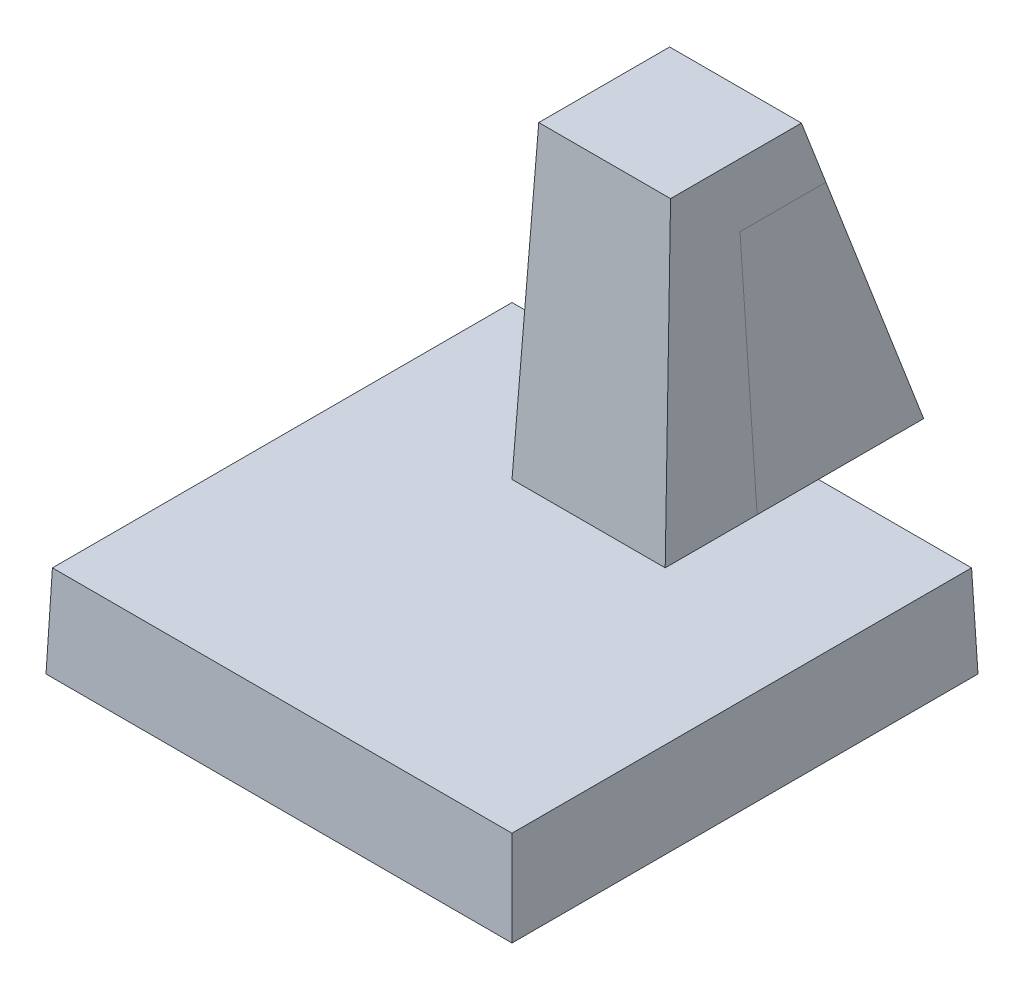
from build123d import *

# Parameters (mm, degrees)
BOSS_EXTRUDE1_DEPTH = 2.5
SKETCH2_W           = 15
SKETCH2_H           = 15
BOSS_EXTRUDE2_DEPTH = 3
BOSS_EXTRUDE2_DRAFT = 2
DRAFT1_ANGLE        = 2
BOSS_EXTRUDE3_DEPTH = 2.5
DRAFT2_ANGLE        = 2


with BuildPart() as part:
    # Sketch1 → Boss-Extrude1 (new, symmetric)
    with BuildSketch(Plane(origin=(0, 0, 0), x_dir=(0, 0, -1), z_dir=(1, 0, 0))):
        Polygon((0, 0), (0.524077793, 10), (4.796137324, 10), (5.524077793, 8), (2.720633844, 8), (3, 0), align=None)
    extrude(amount=BOSS_EXTRUDE1_DEPTH, both=True)


with BuildPart() as boss_extrude2_tool:
    # Sketch2 → Boss-Extrude2 (with draft: the straight prism first)
    with BuildSketch(Plane(origin=(0, 0, 0), x_dir=(1, 0, 0), z_dir=(0, 1, 0))):
        with Locations((0, -2.5)):
            Rectangle(SKETCH2_W, SKETCH2_H)
    extrude(amount=-BOSS_EXTRUDE2_DEPTH)
    # Boss-Extrude2: the draft: its side faces are tilted about the plane it starts from
    boss_extrude2_sides = [boss_extrude2_tool.faces().sort_by_distance(p)[0] for p in [
        (-7.5, -1.5, 2.5),
        (0, -1.5, 10),
        (7.5, -1.5, 2.5),
        (0, -1.5, -5),
    ]]
    draft(boss_extrude2_sides, Plane(origin=(0, 0, 0), x_dir=(1, 0, 0), z_dir=(0, 1, 0)), BOSS_EXTRUDE2_DRAFT)


with BuildPart() as part_1:
    add(part.part)

    # Boss-Extrude2: add boss_extrude2_tool
    add(boss_extrude2_tool.part)

    # Draft1
    draft1_faces = [part_1.faces().sort_by_distance(p)[0] for p in [
        (-2.5, 5.402140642, -1.928064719),
        (2.5, 5.402140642, -1.928064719),
    ]]
    draft(draft1_faces, Plane.ZX, DRAFT1_ANGLE)


with BuildPart() as body_2:
    # Sketch3 → Boss-Extrude3 (new, symmetric)
    with BuildSketch(Plane(origin=(0, 0, 0), x_dir=(0, 0, -1), z_dir=(1, 0, 0))):
        Polygon((2.720633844, 8), (5.524077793, 8), (8.435839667, 0), (3, 0), align=None)
    extrude(amount=BOSS_EXTRUDE3_DEPTH, both=True)

    # Draft2
    draft2_faces = [body_2.faces().sort_by_distance(p)[0] for p in [
        (-2.5, 3.574008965, -5.005099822),
        (2.5, 3.574008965, -5.005099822),
    ]]
    draft(draft2_faces, Plane.ZX, DRAFT2_ANGLE)


solid = Compound([part_1.part, body_2.part])
